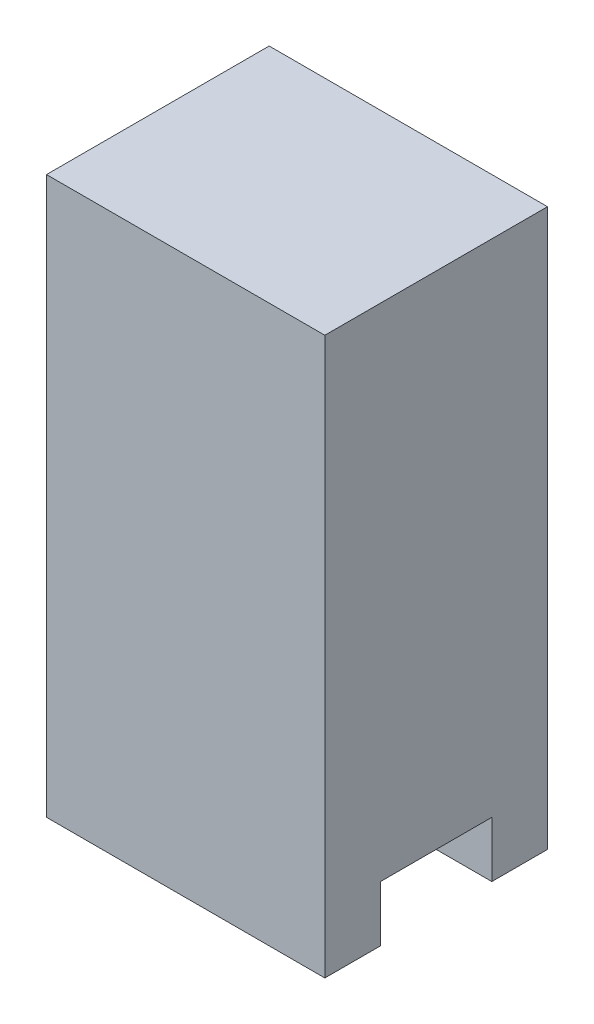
ISO-10303-21;
HEADER;
FILE_DESCRIPTION(('STEP AP214'),'2;1');
FILE_NAME('part.step','',(''),(''),'','','');
FILE_SCHEMA(('AUTOMOTIVE_DESIGN { 1 0 10303 214 1 1 1 1 }'));
ENDSEC;
DATA;
#1=APPLICATION_CONTEXT('core data for automotive mechanical design processes');
#2=APPLICATION_PROTOCOL_DEFINITION('international standard','automotive_design',2000,#1);
#3=PRODUCT_CONTEXT('',#1,'mechanical');
#4=PRODUCT('Part','Part','',(#3));
#5=PRODUCT_RELATED_PRODUCT_CATEGORY('part','',(#4));
#6=PRODUCT_DEFINITION_FORMATION('','',#4);
#7=PRODUCT_DEFINITION_CONTEXT('part definition',#1,'design');
#8=PRODUCT_DEFINITION('design','',#6,#7);
#9=PRODUCT_DEFINITION_SHAPE('','',#8);
#10=(LENGTH_UNIT() NAMED_UNIT(*) SI_UNIT(.MILLI.,.METRE.));
#11=(NAMED_UNIT(*) PLANE_ANGLE_UNIT() SI_UNIT($,.RADIAN.));
#12=(NAMED_UNIT(*) SI_UNIT($,.STERADIAN.) SOLID_ANGLE_UNIT());
#13=UNCERTAINTY_MEASURE_WITH_UNIT(LENGTH_MEASURE(1.E-05),#10,'distance_accuracy_value','');
#14=(GEOMETRIC_REPRESENTATION_CONTEXT(3) GLOBAL_UNCERTAINTY_ASSIGNED_CONTEXT((#13)) GLOBAL_UNIT_ASSIGNED_CONTEXT((#10,
#11,#12)) REPRESENTATION_CONTEXT('',''));
#15=CARTESIAN_POINT('',(0.,0.,0.));
#16=DIRECTION('',(0.,0.,1.));
#17=DIRECTION('',(1.,0.,0.));
#18=AXIS2_PLACEMENT_3D('',#15,#16,#17);
#19=CARTESIAN_POINT('',(0.,0.,40.));
#20=DIRECTION('',(0.,1.,0.));
#21=DIRECTION('',(0.,0.,1.));
#22=AXIS2_PLACEMENT_3D('',#19,#20,#21);
#23=PLANE('',#22);
#24=DIRECTION('',(0.,0.,-1.));
#25=VECTOR('',#24,1.);
#26=CARTESIAN_POINT('',(50.,0.,40.));
#27=LINE('',#26,#25);
#28=CARTESIAN_POINT('',(50.,0.,10.));
#29=VERTEX_POINT('',#28);
#30=CARTESIAN_POINT('',(50.,0.,0.));
#31=VERTEX_POINT('',#30);
#32=EDGE_CURVE('E122',#29,#31,#27,.T.);
#33=ORIENTED_EDGE('',*,*,#32,.F.);
#34=DIRECTION('',(1.,0.,0.));
#35=VECTOR('',#34,1.);
#36=CARTESIAN_POINT('',(50.,0.,10.));
#37=LINE('',#36,#35);
#38=CARTESIAN_POINT('',(0.,0.,10.));
#39=VERTEX_POINT('',#38);
#40=EDGE_CURVE('E117',#39,#29,#37,.T.);
#41=ORIENTED_EDGE('',*,*,#40,.F.);
#42=DIRECTION('',(0.,0.,-1.));
#43=VECTOR('',#42,1.);
#44=CARTESIAN_POINT('',(0.,0.,40.));
#45=LINE('',#44,#43);
#46=CARTESIAN_POINT('',(0.,0.,0.));
#47=VERTEX_POINT('',#46);
#48=EDGE_CURVE('E41',#39,#47,#45,.T.);
#49=ORIENTED_EDGE('',*,*,#48,.T.);
#50=DIRECTION('',(1.,0.,0.));
#51=VECTOR('',#50,1.);
#52=CARTESIAN_POINT('',(0.,0.,0.));
#53=LINE('',#52,#51);
#54=EDGE_CURVE('E140',#47,#31,#53,.T.);
#55=ORIENTED_EDGE('',*,*,#54,.T.);
#56=EDGE_LOOP('',(#33,#41,#49,#55));
#57=FACE_BOUND('',#56,.T.);
#58=ADVANCED_FACE('F33',(#57),#23,.F.);
#59=CARTESIAN_POINT('',(0.,0.,40.));
#60=DIRECTION('',(1.,0.,0.));
#61=DIRECTION('',(0.,0.,-1.));
#62=AXIS2_PLACEMENT_3D('',#59,#60,#61);
#63=PLANE('',#62);
#64=ORIENTED_EDGE('',*,*,#48,.F.);
#65=DIRECTION('',(0.,-1.,0.));
#66=VECTOR('',#65,1.);
#67=CARTESIAN_POINT('',(0.,10.,10.));
#68=LINE('',#67,#66);
#69=CARTESIAN_POINT('',(0.,10.,10.));
#70=VERTEX_POINT('',#69);
#71=EDGE_CURVE('E148',#70,#39,#68,.T.);
#72=ORIENTED_EDGE('',*,*,#71,.F.);
#73=DIRECTION('',(0.,0.,-1.));
#74=VECTOR('',#73,1.);
#75=CARTESIAN_POINT('',(0.,10.,30.));
#76=LINE('',#75,#74);
#77=CARTESIAN_POINT('',(0.,10.,30.));
#78=VERTEX_POINT('',#77);
#79=EDGE_CURVE('E153',#78,#70,#76,.T.);
#80=ORIENTED_EDGE('',*,*,#79,.F.);
#81=DIRECTION('',(0.,-1.,0.));
#82=VECTOR('',#81,1.);
#83=CARTESIAN_POINT('',(0.,10.,30.));
#84=LINE('',#83,#82);
#85=CARTESIAN_POINT('',(0.,0.,30.));
#86=VERTEX_POINT('',#85);
#87=EDGE_CURVE('E109',#78,#86,#84,.T.);
#88=ORIENTED_EDGE('',*,*,#87,.T.);
#89=CARTESIAN_POINT('',(0.,0.,40.));
#90=VERTEX_POINT('',#89);
#91=EDGE_CURVE('E11',#90,#86,#45,.T.);
#92=ORIENTED_EDGE('',*,*,#91,.F.);
#93=DIRECTION('',(0.,-1.,0.));
#94=VECTOR('',#93,1.);
#95=CARTESIAN_POINT('',(0.,0.,40.));
#96=LINE('',#95,#94);
#97=CARTESIAN_POINT('',(0.,100.,40.));
#98=VERTEX_POINT('',#97);
#99=EDGE_CURVE('E134',#98,#90,#96,.T.);
#100=ORIENTED_EDGE('',*,*,#99,.F.);
#101=DIRECTION('',(0.,0.,-1.));
#102=VECTOR('',#101,1.);
#103=CARTESIAN_POINT('',(0.,100.,40.));
#104=LINE('',#103,#102);
#105=CARTESIAN_POINT('',(0.,100.,0.));
#106=VERTEX_POINT('',#105);
#107=EDGE_CURVE('E127',#98,#106,#104,.T.);
#108=ORIENTED_EDGE('',*,*,#107,.T.);
#109=DIRECTION('',(0.,-1.,0.));
#110=VECTOR('',#109,1.);
#111=CARTESIAN_POINT('',(0.,0.,0.));
#112=LINE('',#111,#110);
#113=EDGE_CURVE('E143',#106,#47,#112,.T.);
#114=ORIENTED_EDGE('',*,*,#113,.T.);
#115=EDGE_LOOP('',(#64,#72,#80,#88,#92,#100,#108,#114));
#116=FACE_BOUND('',#115,.T.);
#117=ADVANCED_FACE('F35',(#116),#63,.F.);
#118=ORIENTED_EDGE('',*,*,#91,.T.);
#119=DIRECTION('',(-1.,0.,0.));
#120=VECTOR('',#119,1.);
#121=CARTESIAN_POINT('',(50.,0.,30.));
#122=LINE('',#121,#120);
#123=CARTESIAN_POINT('',(50.,0.,30.));
#124=VERTEX_POINT('',#123);
#125=EDGE_CURVE('E102',#124,#86,#122,.T.);
#126=ORIENTED_EDGE('',*,*,#125,.F.);
#127=CARTESIAN_POINT('',(50.,0.,40.));
#128=VERTEX_POINT('',#127);
#129=EDGE_CURVE('E114',#128,#124,#27,.T.);
#130=ORIENTED_EDGE('',*,*,#129,.F.);
#131=DIRECTION('',(1.,0.,0.));
#132=VECTOR('',#131,1.);
#133=CARTESIAN_POINT('',(0.,0.,40.));
#134=LINE('',#133,#132);
#135=EDGE_CURVE('E132',#90,#128,#134,.T.);
#136=ORIENTED_EDGE('',*,*,#135,.F.);
#137=EDGE_LOOP('',(#118,#126,#130,#136));
#138=FACE_BOUND('',#137,.T.);
#139=ADVANCED_FACE('F113',(#138),#23,.F.);
#140=CARTESIAN_POINT('',(50.,0.,40.));
#141=DIRECTION('',(-1.,0.,0.));
#142=DIRECTION('',(0.,0.,1.));
#143=AXIS2_PLACEMENT_3D('',#140,#141,#142);
#144=PLANE('',#143);
#145=DIRECTION('',(0.,0.,1.));
#146=VECTOR('',#145,1.);
#147=CARTESIAN_POINT('',(50.,10.,30.));
#148=LINE('',#147,#146);
#149=CARTESIAN_POINT('',(50.,10.,10.));
#150=VERTEX_POINT('',#149);
#151=CARTESIAN_POINT('',(50.,10.,30.));
#152=VERTEX_POINT('',#151);
#153=EDGE_CURVE('E156',#150,#152,#148,.T.);
#154=ORIENTED_EDGE('',*,*,#153,.F.);
#155=DIRECTION('',(0.,-1.,0.));
#156=VECTOR('',#155,1.);
#157=CARTESIAN_POINT('',(50.,10.,10.));
#158=LINE('',#157,#156);
#159=EDGE_CURVE('E145',#150,#29,#158,.T.);
#160=ORIENTED_EDGE('',*,*,#159,.T.);
#161=ORIENTED_EDGE('',*,*,#32,.T.);
#162=DIRECTION('',(0.,1.,0.));
#163=VECTOR('',#162,1.);
#164=CARTESIAN_POINT('',(50.,0.,0.));
#165=LINE('',#164,#163);
#166=CARTESIAN_POINT('',(50.,100.,0.));
#167=VERTEX_POINT('',#166);
#168=EDGE_CURVE('E138',#31,#167,#165,.T.);
#169=ORIENTED_EDGE('',*,*,#168,.T.);
#170=DIRECTION('',(0.,0.,-1.));
#171=VECTOR('',#170,1.);
#172=CARTESIAN_POINT('',(50.,100.,40.));
#173=LINE('',#172,#171);
#174=CARTESIAN_POINT('',(50.,100.,40.));
#175=VERTEX_POINT('',#174);
#176=EDGE_CURVE('E123',#175,#167,#173,.T.);
#177=ORIENTED_EDGE('',*,*,#176,.F.);
#178=DIRECTION('',(0.,1.,0.));
#179=VECTOR('',#178,1.);
#180=CARTESIAN_POINT('',(50.,0.,40.));
#181=LINE('',#180,#179);
#182=EDGE_CURVE('E121',#128,#175,#181,.T.);
#183=ORIENTED_EDGE('',*,*,#182,.F.);
#184=ORIENTED_EDGE('',*,*,#129,.T.);
#185=DIRECTION('',(0.,-1.,0.));
#186=VECTOR('',#185,1.);
#187=CARTESIAN_POINT('',(50.,10.,30.));
#188=LINE('',#187,#186);
#189=EDGE_CURVE('E99',#152,#124,#188,.T.);
#190=ORIENTED_EDGE('',*,*,#189,.F.);
#191=EDGE_LOOP('',(#154,#160,#161,#169,#177,#183,#184,#190));
#192=FACE_BOUND('',#191,.T.);
#193=ADVANCED_FACE('F119',(#192),#144,.F.);
#194=CARTESIAN_POINT('',(0.,100.,40.));
#195=DIRECTION('',(0.,-1.,0.));
#196=DIRECTION('',(0.,0.,-1.));
#197=AXIS2_PLACEMENT_3D('',#194,#195,#196);
#198=PLANE('',#197);
#199=DIRECTION('',(-1.,0.,0.));
#200=VECTOR('',#199,1.);
#201=CARTESIAN_POINT('',(0.,100.,0.));
#202=LINE('',#201,#200);
#203=EDGE_CURVE('E136',#167,#106,#202,.T.);
#204=ORIENTED_EDGE('',*,*,#203,.T.);
#205=ORIENTED_EDGE('',*,*,#107,.F.);
#206=DIRECTION('',(-1.,0.,0.));
#207=VECTOR('',#206,1.);
#208=CARTESIAN_POINT('',(0.,100.,40.));
#209=LINE('',#208,#207);
#210=EDGE_CURVE('E56',#175,#98,#209,.T.);
#211=ORIENTED_EDGE('',*,*,#210,.F.);
#212=ORIENTED_EDGE('',*,*,#176,.T.);
#213=EDGE_LOOP('',(#204,#205,#211,#212));
#214=FACE_BOUND('',#213,.T.);
#215=ADVANCED_FACE('F172',(#214),#198,.F.);
#216=CARTESIAN_POINT('',(0.,100.,40.));
#217=DIRECTION('',(0.,0.,-1.));
#218=DIRECTION('',(-1.,0.,0.));
#219=AXIS2_PLACEMENT_3D('',#216,#217,#218);
#220=PLANE('',#219);
#221=ORIENTED_EDGE('',*,*,#99,.T.);
#222=ORIENTED_EDGE('',*,*,#135,.T.);
#223=ORIENTED_EDGE('',*,*,#182,.T.);
#224=ORIENTED_EDGE('',*,*,#210,.T.);
#225=EDGE_LOOP('',(#221,#222,#223,#224));
#226=FACE_BOUND('',#225,.T.);
#227=ADVANCED_FACE('F175',(#226),#220,.F.);
#228=CARTESIAN_POINT('',(0.,100.,0.));
#229=DIRECTION('',(0.,0.,-1.));
#230=DIRECTION('',(-1.,0.,0.));
#231=AXIS2_PLACEMENT_3D('',#228,#229,#230);
#232=PLANE('',#231);
#233=ORIENTED_EDGE('',*,*,#113,.F.);
#234=ORIENTED_EDGE('',*,*,#203,.F.);
#235=ORIENTED_EDGE('',*,*,#168,.F.);
#236=ORIENTED_EDGE('',*,*,#54,.F.);
#237=EDGE_LOOP('',(#233,#234,#235,#236));
#238=FACE_BOUND('',#237,.T.);
#239=ADVANCED_FACE('F170',(#238),#232,.T.);
#240=CARTESIAN_POINT('',(50.,10.,10.));
#241=DIRECTION('',(0.,0.,-1.));
#242=DIRECTION('',(-1.,0.,0.));
#243=AXIS2_PLACEMENT_3D('',#240,#241,#242);
#244=PLANE('',#243);
#245=ORIENTED_EDGE('',*,*,#40,.T.);
#246=ORIENTED_EDGE('',*,*,#159,.F.);
#247=DIRECTION('',(1.,0.,0.));
#248=VECTOR('',#247,1.);
#249=CARTESIAN_POINT('',(50.,10.,10.));
#250=LINE('',#249,#248);
#251=EDGE_CURVE('E48',#70,#150,#250,.T.);
#252=ORIENTED_EDGE('',*,*,#251,.F.);
#253=ORIENTED_EDGE('',*,*,#71,.T.);
#254=EDGE_LOOP('',(#245,#246,#252,#253));
#255=FACE_BOUND('',#254,.T.);
#256=ADVANCED_FACE('F160',(#255),#244,.F.);
#257=CARTESIAN_POINT('',(50.,10.,30.));
#258=DIRECTION('',(0.,0.,1.));
#259=DIRECTION('',(1.,0.,0.));
#260=AXIS2_PLACEMENT_3D('',#257,#258,#259);
#261=PLANE('',#260);
#262=ORIENTED_EDGE('',*,*,#125,.T.);
#263=ORIENTED_EDGE('',*,*,#87,.F.);
#264=DIRECTION('',(-1.,0.,0.));
#265=VECTOR('',#264,1.);
#266=CARTESIAN_POINT('',(50.,10.,30.));
#267=LINE('',#266,#265);
#268=EDGE_CURVE('E105',#152,#78,#267,.T.);
#269=ORIENTED_EDGE('',*,*,#268,.F.);
#270=ORIENTED_EDGE('',*,*,#189,.T.);
#271=EDGE_LOOP('',(#262,#263,#269,#270));
#272=FACE_BOUND('',#271,.T.);
#273=ADVANCED_FACE('F101',(#272),#261,.F.);
#274=CARTESIAN_POINT('',(50.,10.,10.));
#275=DIRECTION('',(0.,1.,0.));
#276=DIRECTION('',(0.,0.,1.));
#277=AXIS2_PLACEMENT_3D('',#274,#275,#276);
#278=PLANE('',#277);
#279=ORIENTED_EDGE('',*,*,#153,.T.);
#280=ORIENTED_EDGE('',*,*,#268,.T.);
#281=ORIENTED_EDGE('',*,*,#79,.T.);
#282=ORIENTED_EDGE('',*,*,#251,.T.);
#283=EDGE_LOOP('',(#279,#280,#281,#282));
#284=FACE_BOUND('',#283,.T.);
#285=ADVANCED_FACE('F228',(#284),#278,.F.);
#286=CLOSED_SHELL('',(#58,#117,#139,#193,#215,#227,#239,#256,#273,#285));
#287=MANIFOLD_SOLID_BREP('B2',#286);
#288=ADVANCED_BREP_SHAPE_REPRESENTATION('',(#18,#287),#14);
#289=SHAPE_DEFINITION_REPRESENTATION(#9,#288);
ENDSEC;
END-ISO-10303-21;
